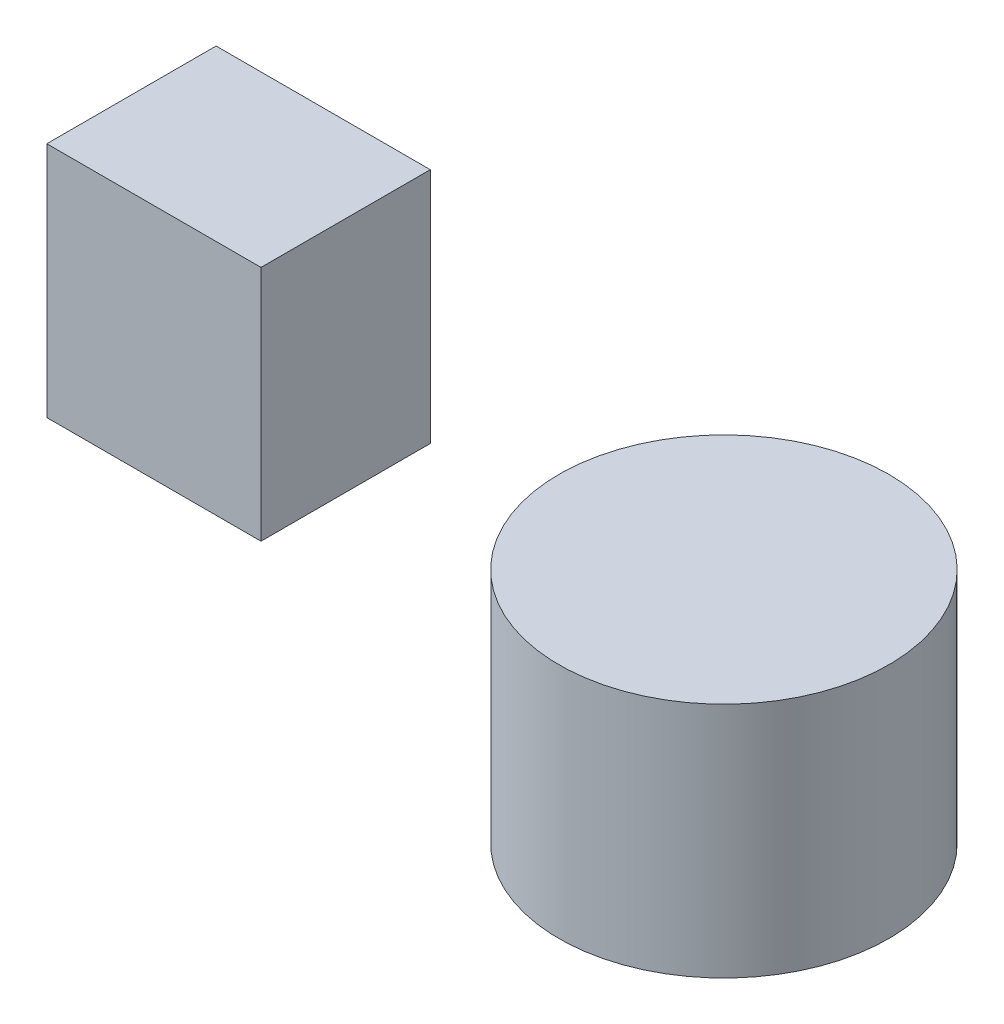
ISO-10303-21;
HEADER;
FILE_DESCRIPTION(('STEP AP214'),'2;1');
FILE_NAME('part.step','',(''),(''),'','','');
FILE_SCHEMA(('AUTOMOTIVE_DESIGN { 1 0 10303 214 1 1 1 1 }'));
ENDSEC;
DATA;
#1=APPLICATION_CONTEXT('core data for automotive mechanical design processes');
#2=APPLICATION_PROTOCOL_DEFINITION('international standard','automotive_design',2000,#1);
#3=PRODUCT_CONTEXT('',#1,'mechanical');
#4=PRODUCT('Part','Part','',(#3));
#5=PRODUCT_RELATED_PRODUCT_CATEGORY('part','',(#4));
#6=PRODUCT_DEFINITION_FORMATION('','',#4);
#7=PRODUCT_DEFINITION_CONTEXT('part definition',#1,'design');
#8=PRODUCT_DEFINITION('design','',#6,#7);
#9=PRODUCT_DEFINITION_SHAPE('','',#8);
#10=(LENGTH_UNIT() NAMED_UNIT(*) SI_UNIT(.MILLI.,.METRE.));
#11=(NAMED_UNIT(*) PLANE_ANGLE_UNIT() SI_UNIT($,.RADIAN.));
#12=(NAMED_UNIT(*) SI_UNIT($,.STERADIAN.) SOLID_ANGLE_UNIT());
#13=UNCERTAINTY_MEASURE_WITH_UNIT(LENGTH_MEASURE(1.E-05),#10,'distance_accuracy_value','');
#14=(GEOMETRIC_REPRESENTATION_CONTEXT(3) GLOBAL_UNCERTAINTY_ASSIGNED_CONTEXT((#13)) GLOBAL_UNIT_ASSIGNED_CONTEXT((#10,
#11,#12)) REPRESENTATION_CONTEXT('',''));
#15=CARTESIAN_POINT('',(0.,0.,0.));
#16=DIRECTION('',(0.,0.,1.));
#17=DIRECTION('',(1.,0.,0.));
#18=AXIS2_PLACEMENT_3D('',#15,#16,#17);
#19=CARTESIAN_POINT('',(-108.125611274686,52.,-43.7425852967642));
#20=DIRECTION('',(-1.,0.,0.));
#21=DIRECTION('',(0.,0.,1.));
#22=AXIS2_PLACEMENT_3D('',#19,#20,#21);
#23=PLANE('',#22);
#24=DIRECTION('',(0.,0.,-1.));
#25=VECTOR('',#24,1.);
#26=CARTESIAN_POINT('',(-108.125611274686,0.,-43.7425852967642));
#27=LINE('',#26,#25);
#28=CARTESIAN_POINT('',(-108.125611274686,0.,-6.62766443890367));
#29=VERTEX_POINT('',#28);
#30=CARTESIAN_POINT('',(-108.125611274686,0.,-43.7425852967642));
#31=VERTEX_POINT('',#30);
#32=EDGE_CURVE('E103',#29,#31,#27,.T.);
#33=ORIENTED_EDGE('',*,*,#32,.T.);
#34=DIRECTION('',(0.,-1.,0.));
#35=VECTOR('',#34,1.);
#36=CARTESIAN_POINT('',(-108.125611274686,52.,-43.7425852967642));
#37=LINE('',#36,#35);
#38=CARTESIAN_POINT('',(-108.125611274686,52.,-43.7425852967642));
#39=VERTEX_POINT('',#38);
#40=EDGE_CURVE('E12',#39,#31,#37,.T.);
#41=ORIENTED_EDGE('',*,*,#40,.F.);
#42=DIRECTION('',(0.,0.,-1.));
#43=VECTOR('',#42,1.);
#44=CARTESIAN_POINT('',(-108.125611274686,52.,-43.7425852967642));
#45=LINE('',#44,#43);
#46=CARTESIAN_POINT('',(-108.125611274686,52.,-6.62766443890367));
#47=VERTEX_POINT('',#46);
#48=EDGE_CURVE('E91',#47,#39,#45,.T.);
#49=ORIENTED_EDGE('',*,*,#48,.F.);
#50=DIRECTION('',(0.,-1.,0.));
#51=VECTOR('',#50,1.);
#52=CARTESIAN_POINT('',(-108.125611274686,52.,-6.62766443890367));
#53=LINE('',#52,#51);
#54=EDGE_CURVE('E99',#47,#29,#53,.T.);
#55=ORIENTED_EDGE('',*,*,#54,.T.);
#56=EDGE_LOOP('',(#33,#41,#49,#55));
#57=FACE_BOUND('',#56,.T.);
#58=ADVANCED_FACE('F40',(#57),#23,.F.);
#59=CARTESIAN_POINT('',(-155.087347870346,52.,-43.7425852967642));
#60=DIRECTION('',(0.,0.,1.));
#61=DIRECTION('',(1.,0.,0.));
#62=AXIS2_PLACEMENT_3D('',#59,#60,#61);
#63=PLANE('',#62);
#64=DIRECTION('',(-1.,0.,0.));
#65=VECTOR('',#64,1.);
#66=CARTESIAN_POINT('',(-155.087347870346,0.,-43.7425852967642));
#67=LINE('',#66,#65);
#68=CARTESIAN_POINT('',(-155.087347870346,0.,-43.7425852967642));
#69=VERTEX_POINT('',#68);
#70=EDGE_CURVE('E95',#31,#69,#67,.T.);
#71=ORIENTED_EDGE('',*,*,#70,.T.);
#72=DIRECTION('',(0.,-1.,0.));
#73=VECTOR('',#72,1.);
#74=CARTESIAN_POINT('',(-155.087347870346,52.,-43.7425852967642));
#75=LINE('',#74,#73);
#76=CARTESIAN_POINT('',(-155.087347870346,52.,-43.7425852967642));
#77=VERTEX_POINT('',#76);
#78=EDGE_CURVE('E48',#77,#69,#75,.T.);
#79=ORIENTED_EDGE('',*,*,#78,.F.);
#80=DIRECTION('',(-1.,0.,0.));
#81=VECTOR('',#80,1.);
#82=CARTESIAN_POINT('',(-155.087347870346,52.,-43.7425852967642));
#83=LINE('',#82,#81);
#84=EDGE_CURVE('E86',#39,#77,#83,.T.);
#85=ORIENTED_EDGE('',*,*,#84,.F.);
#86=ORIENTED_EDGE('',*,*,#40,.T.);
#87=EDGE_LOOP('',(#71,#79,#85,#86));
#88=FACE_BOUND('',#87,.T.);
#89=ADVANCED_FACE('F94',(#88),#63,.F.);
#90=CARTESIAN_POINT('',(-155.087347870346,52.,-43.7425852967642));
#91=DIRECTION('',(1.,0.,0.));
#92=DIRECTION('',(0.,0.,-1.));
#93=AXIS2_PLACEMENT_3D('',#90,#91,#92);
#94=PLANE('',#93);
#95=DIRECTION('',(0.,0.,1.));
#96=VECTOR('',#95,1.);
#97=CARTESIAN_POINT('',(-155.087347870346,0.,-43.7425852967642));
#98=LINE('',#97,#96);
#99=CARTESIAN_POINT('',(-155.087347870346,0.,-6.62766443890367));
#100=VERTEX_POINT('',#99);
#101=EDGE_CURVE('E73',#69,#100,#98,.T.);
#102=ORIENTED_EDGE('',*,*,#101,.T.);
#103=DIRECTION('',(0.,-1.,0.));
#104=VECTOR('',#103,1.);
#105=CARTESIAN_POINT('',(-155.087347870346,52.,-6.62766443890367));
#106=LINE('',#105,#104);
#107=CARTESIAN_POINT('',(-155.087347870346,52.,-6.62766443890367));
#108=VERTEX_POINT('',#107);
#109=EDGE_CURVE('E96',#108,#100,#106,.T.);
#110=ORIENTED_EDGE('',*,*,#109,.F.);
#111=DIRECTION('',(0.,0.,1.));
#112=VECTOR('',#111,1.);
#113=CARTESIAN_POINT('',(-155.087347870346,52.,-43.7425852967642));
#114=LINE('',#113,#112);
#115=EDGE_CURVE('E89',#77,#108,#114,.T.);
#116=ORIENTED_EDGE('',*,*,#115,.F.);
#117=ORIENTED_EDGE('',*,*,#78,.T.);
#118=EDGE_LOOP('',(#102,#110,#116,#117));
#119=FACE_BOUND('',#118,.T.);
#120=ADVANCED_FACE('F97',(#119),#94,.F.);
#121=CARTESIAN_POINT('',(-155.087347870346,52.,-6.62766443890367));
#122=DIRECTION('',(0.,0.,-1.));
#123=DIRECTION('',(-1.,0.,0.));
#124=AXIS2_PLACEMENT_3D('',#121,#122,#123);
#125=PLANE('',#124);
#126=DIRECTION('',(1.,0.,0.));
#127=VECTOR('',#126,1.);
#128=CARTESIAN_POINT('',(-155.087347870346,0.,-6.62766443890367));
#129=LINE('',#128,#127);
#130=EDGE_CURVE('E79',#100,#29,#129,.T.);
#131=ORIENTED_EDGE('',*,*,#130,.T.);
#132=ORIENTED_EDGE('',*,*,#54,.F.);
#133=DIRECTION('',(1.,0.,0.));
#134=VECTOR('',#133,1.);
#135=CARTESIAN_POINT('',(-155.087347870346,52.,-6.62766443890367));
#136=LINE('',#135,#134);
#137=EDGE_CURVE('E56',#108,#47,#136,.T.);
#138=ORIENTED_EDGE('',*,*,#137,.F.);
#139=ORIENTED_EDGE('',*,*,#109,.T.);
#140=EDGE_LOOP('',(#131,#132,#138,#139));
#141=FACE_BOUND('',#140,.T.);
#142=ADVANCED_FACE('F110',(#141),#125,.F.);
#143=CARTESIAN_POINT('',(0.,52.,0.));
#144=DIRECTION('',(0.,1.,0.));
#145=DIRECTION('',(0.,0.,1.));
#146=AXIS2_PLACEMENT_3D('',#143,#144,#145);
#147=PLANE('',#146);
#148=ORIENTED_EDGE('',*,*,#48,.T.);
#149=ORIENTED_EDGE('',*,*,#84,.T.);
#150=ORIENTED_EDGE('',*,*,#115,.T.);
#151=ORIENTED_EDGE('',*,*,#137,.T.);
#152=EDGE_LOOP('',(#148,#149,#150,#151));
#153=FACE_BOUND('',#152,.T.);
#154=ADVANCED_FACE('F87',(#153),#147,.T.);
#155=CARTESIAN_POINT('',(0.,0.,0.));
#156=DIRECTION('',(0.,1.,0.));
#157=DIRECTION('',(0.,0.,1.));
#158=AXIS2_PLACEMENT_3D('',#155,#156,#157);
#159=PLANE('',#158);
#160=ORIENTED_EDGE('',*,*,#32,.F.);
#161=ORIENTED_EDGE('',*,*,#130,.F.);
#162=ORIENTED_EDGE('',*,*,#101,.F.);
#163=ORIENTED_EDGE('',*,*,#70,.F.);
#164=EDGE_LOOP('',(#160,#161,#162,#163));
#165=FACE_BOUND('',#164,.T.);
#166=ADVANCED_FACE('F113',(#165),#159,.F.);
#167=CLOSED_SHELL('',(#58,#89,#120,#142,#154,#166));
#168=MANIFOLD_SOLID_BREP('B2',#167);
#169=CARTESIAN_POINT('',(0.,52.,0.));
#170=DIRECTION('',(0.,-1.,0.));
#171=DIRECTION('',(0.,0.,-1.));
#172=AXIS2_PLACEMENT_3D('',#169,#170,#171);
#173=CYLINDRICAL_SURFACE('',#172,36.1681116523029);
#174=CARTESIAN_POINT('',(0.,52.,0.));
#175=DIRECTION('',(0.,1.,0.));
#176=DIRECTION('',(0.,0.,1.));
#177=AXIS2_PLACEMENT_3D('',#174,#175,#176);
#178=CIRCLE('',#177,36.1681116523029);
#179=CARTESIAN_POINT('',(0.,52.,-36.1681116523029));
#180=VERTEX_POINT('',#179);
#181=EDGE_CURVE('E39',#180,#180,#178,.T.);
#182=CARTESIAN_POINT('',(0.,0.,0.));
#183=DIRECTION('',(0.,1.,0.));
#184=DIRECTION('',(0.,0.,1.));
#185=AXIS2_PLACEMENT_3D('',#182,#183,#184);
#186=CIRCLE('',#185,36.1681116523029);
#187=CARTESIAN_POINT('',(0.,0.,-36.1681116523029));
#188=VERTEX_POINT('',#187);
#189=EDGE_CURVE('E166',#188,#188,#186,.T.);
#190=CARTESIAN_POINT('',(0.,52.,-36.1681116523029));
#191=CARTESIAN_POINT('',(0.,51.4583333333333,-36.1681116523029));
#192=CARTESIAN_POINT('',(0.,50.9166666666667,-36.1681116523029));
#193=CARTESIAN_POINT('',(0.,49.8333333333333,-36.1681116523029));
#194=CARTESIAN_POINT('',(0.,49.2916666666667,-36.1681116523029));
#195=CARTESIAN_POINT('',(0.,48.2083333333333,-36.1681116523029));
#196=CARTESIAN_POINT('',(0.,47.6666666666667,-36.1681116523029));
#197=CARTESIAN_POINT('',(0.,46.5833333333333,-36.1681116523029));
#198=CARTESIAN_POINT('',(0.,46.0416666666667,-36.1681116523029));
#199=CARTESIAN_POINT('',(0.,44.9583333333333,-36.1681116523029));
#200=CARTESIAN_POINT('',(0.,44.4166666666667,-36.1681116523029));
#201=CARTESIAN_POINT('',(0.,43.3333333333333,-36.1681116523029));
#202=CARTESIAN_POINT('',(0.,42.7916666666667,-36.1681116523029));
#203=CARTESIAN_POINT('',(0.,41.7083333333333,-36.1681116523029));
#204=CARTESIAN_POINT('',(0.,41.1666666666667,-36.1681116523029));
#205=CARTESIAN_POINT('',(0.,40.0833333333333,-36.1681116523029));
#206=CARTESIAN_POINT('',(0.,39.5416666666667,-36.1681116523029));
#207=CARTESIAN_POINT('',(0.,38.4583333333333,-36.1681116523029));
#208=CARTESIAN_POINT('',(0.,37.9166666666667,-36.1681116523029));
#209=CARTESIAN_POINT('',(0.,36.8333333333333,-36.1681116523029));
#210=CARTESIAN_POINT('',(0.,36.2916666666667,-36.1681116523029));
#211=CARTESIAN_POINT('',(0.,35.2083333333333,-36.1681116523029));
#212=CARTESIAN_POINT('',(0.,34.6666666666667,-36.1681116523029));
#213=CARTESIAN_POINT('',(0.,33.5833333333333,-36.1681116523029));
#214=CARTESIAN_POINT('',(0.,33.0416666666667,-36.1681116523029));
#215=CARTESIAN_POINT('',(0.,31.9583333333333,-36.1681116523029));
#216=CARTESIAN_POINT('',(0.,31.4166666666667,-36.1681116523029));
#217=CARTESIAN_POINT('',(0.,30.3333333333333,-36.1681116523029));
#218=CARTESIAN_POINT('',(0.,29.7916666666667,-36.1681116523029));
#219=CARTESIAN_POINT('',(0.,28.7083333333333,-36.1681116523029));
#220=CARTESIAN_POINT('',(0.,28.1666666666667,-36.1681116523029));
#221=CARTESIAN_POINT('',(0.,27.0833333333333,-36.1681116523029));
#222=CARTESIAN_POINT('',(0.,26.5416666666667,-36.1681116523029));
#223=CARTESIAN_POINT('',(0.,25.4583333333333,-36.1681116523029));
#224=CARTESIAN_POINT('',(0.,24.9166666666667,-36.1681116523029));
#225=CARTESIAN_POINT('',(0.,23.8333333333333,-36.1681116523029));
#226=CARTESIAN_POINT('',(0.,23.2916666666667,-36.1681116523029));
#227=CARTESIAN_POINT('',(0.,22.2083333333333,-36.1681116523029));
#228=CARTESIAN_POINT('',(0.,21.6666666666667,-36.1681116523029));
#229=CARTESIAN_POINT('',(0.,20.5833333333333,-36.1681116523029));
#230=CARTESIAN_POINT('',(0.,20.0416666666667,-36.1681116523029));
#231=CARTESIAN_POINT('',(0.,18.9583333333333,-36.1681116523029));
#232=CARTESIAN_POINT('',(0.,18.4166666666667,-36.1681116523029));
#233=CARTESIAN_POINT('',(0.,17.3333333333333,-36.1681116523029));
#234=CARTESIAN_POINT('',(0.,16.7916666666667,-36.1681116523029));
#235=CARTESIAN_POINT('',(0.,15.7083333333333,-36.1681116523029));
#236=CARTESIAN_POINT('',(0.,15.1666666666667,-36.1681116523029));
#237=CARTESIAN_POINT('',(0.,14.0833333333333,-36.1681116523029));
#238=CARTESIAN_POINT('',(0.,13.5416666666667,-36.1681116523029));
#239=CARTESIAN_POINT('',(0.,12.4583333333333,-36.1681116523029));
#240=CARTESIAN_POINT('',(0.,11.9166666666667,-36.1681116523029));
#241=CARTESIAN_POINT('',(0.,10.8333333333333,-36.1681116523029));
#242=CARTESIAN_POINT('',(0.,10.2916666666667,-36.1681116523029));
#243=CARTESIAN_POINT('',(0.,9.20833333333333,-36.1681116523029));
#244=CARTESIAN_POINT('',(0.,8.66666666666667,-36.1681116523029));
#245=CARTESIAN_POINT('',(0.,7.58333333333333,-36.1681116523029));
#246=CARTESIAN_POINT('',(0.,7.04166666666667,-36.1681116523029));
#247=CARTESIAN_POINT('',(0.,5.95833333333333,-36.1681116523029));
#248=CARTESIAN_POINT('',(0.,5.41666666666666,-36.1681116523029));
#249=CARTESIAN_POINT('',(0.,4.33333333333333,-36.1681116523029));
#250=CARTESIAN_POINT('',(0.,3.79166666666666,-36.1681116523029));
#251=CARTESIAN_POINT('',(0.,2.70833333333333,-36.1681116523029));
#252=CARTESIAN_POINT('',(0.,2.16666666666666,-36.1681116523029));
#253=CARTESIAN_POINT('',(0.,1.08333333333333,-36.1681116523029));
#254=CARTESIAN_POINT('',(0.,0.54166666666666,-36.1681116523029));
#255=CARTESIAN_POINT('',(0.,0.,-36.1681116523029));
#256=B_SPLINE_CURVE_WITH_KNOTS('',3,(#190,#191,#192,#193,#194,#195,#196,#197,#198,#199,#200,
#201,#202,#203,#204,#205,#206,#207,#208,#209,#210,#211,#212,#213,#214,#215,#216,#217,#218,#219,
#220,#221,#222,#223,#224,#225,#226,#227,#228,#229,#230,#231,#232,#233,#234,#235,#236,#237,#238,
#239,#240,#241,#242,#243,#244,#245,#246,#247,#248,#249,#250,#251,#252,#253,#254,#255),
.UNSPECIFIED.,.F.,.F.,(4,2,2,2,2,2,2,2,2,2,2,2,2,2,2,2,2,2,2,2,2,2,2,2,2,2,2,2,2,2,2,2,4),(0.,
1.625,3.25,4.875,6.50000000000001,8.12500000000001,9.75000000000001,11.375,13.,14.625,16.25,
17.875,19.5,21.125,22.75,24.375,26.,27.625,29.25,30.875,32.5,34.125,35.75,37.375,39.,40.625,
42.25,43.875,45.5,47.125,48.75,50.375,52.),.UNSPECIFIED.);
#257=EDGE_CURVE('BSEAM163',#180,#188,#256,.T.);
#258=ORIENTED_EDGE('',*,*,#181,.F.);
#259=ORIENTED_EDGE('',*,*,#189,.T.);
#260=ORIENTED_EDGE('',*,*,#257,.T.);
#261=ORIENTED_EDGE('',*,*,#257,.F.);
#262=EDGE_LOOP('',(#258,#260,#259,#261));
#263=FACE_BOUND('',#262,.T.);
#264=ADVANCED_FACE('F163',(#263),#173,.T.);
#265=CARTESIAN_POINT('',(0.,52.,0.));
#266=DIRECTION('',(0.,1.,0.));
#267=DIRECTION('',(0.,0.,1.));
#268=AXIS2_PLACEMENT_3D('',#265,#266,#267);
#269=PLANE('',#268);
#270=ORIENTED_EDGE('',*,*,#181,.T.);
#271=EDGE_LOOP('',(#270));
#272=FACE_BOUND('',#271,.T.);
#273=ADVANCED_FACE('F178',(#272),#269,.T.);
#274=CARTESIAN_POINT('',(0.,0.,0.));
#275=DIRECTION('',(0.,1.,0.));
#276=DIRECTION('',(0.,0.,1.));
#277=AXIS2_PLACEMENT_3D('',#274,#275,#276);
#278=PLANE('',#277);
#279=ORIENTED_EDGE('',*,*,#189,.F.);
#280=EDGE_LOOP('',(#279));
#281=FACE_BOUND('',#280,.T.);
#282=ADVANCED_FACE('F176',(#281),#278,.F.);
#283=CLOSED_SHELL('',(#264,#273,#282));
#284=MANIFOLD_SOLID_BREP('B6',#283);
#285=ADVANCED_BREP_SHAPE_REPRESENTATION('',(#18,#168,#284),#14);
#286=SHAPE_DEFINITION_REPRESENTATION(#9,#285);
ENDSEC;
END-ISO-10303-21;
